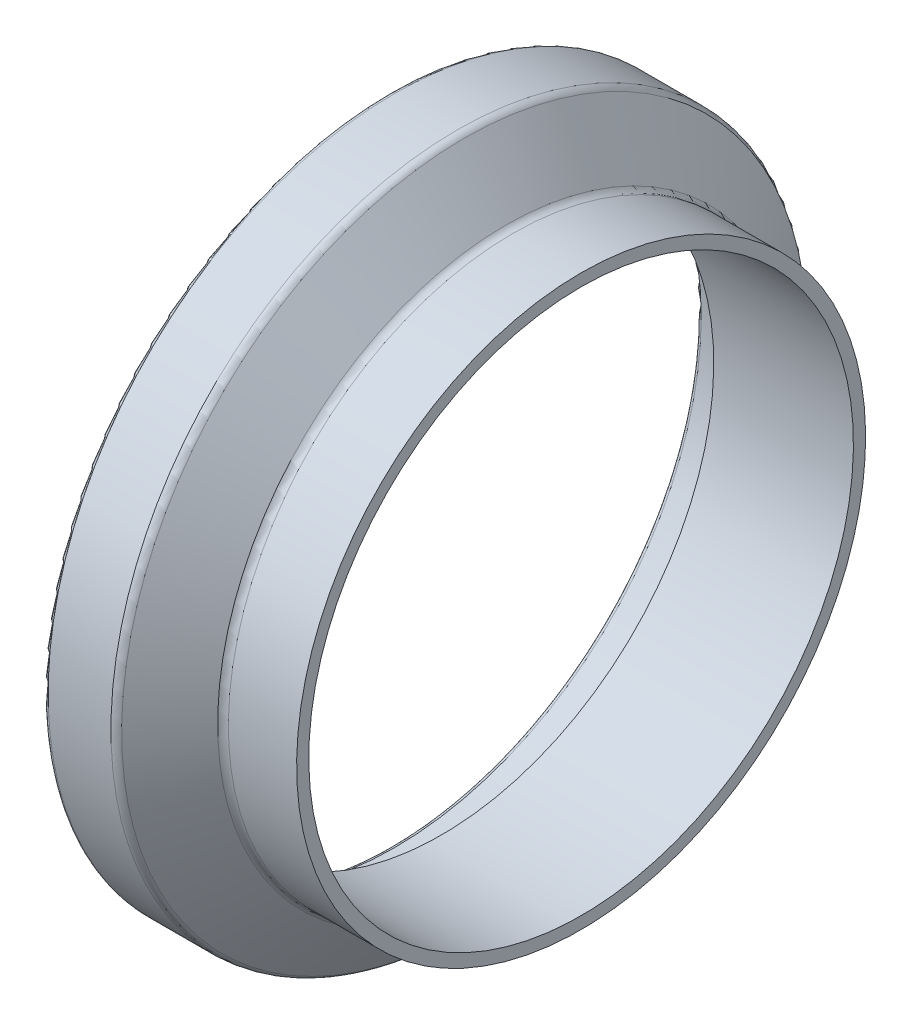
from build123d import *


with BuildPart() as part:
    # Sketch1 → Revolve1 (revolve)
    with BuildSketch(Plane.XY):
        with BuildLine():
            Line((-1.651983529, 48.6283), (-26.594783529, 48.6283))
            Line((-26.594783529, 48.6283), (-26.594783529, 53.9623))
            ThreePointArc((-26.594783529, 53.9623), (-26.832847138, 54.537036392), (-27.407583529, 54.7751))
            Line((-27.407583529, 54.7751), (-34.976783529, 54.7751))
            ThreePointArc((-34.976783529, 54.7751), (-35.551519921, 55.013163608), (-35.789583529, 55.5879))
            Line((-35.789583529, 55.5879), (-35.789583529, 61.0362))
            ThreePointArc((-35.789583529, 61.0362), (-35.551519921, 61.610936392), (-34.976783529, 61.849))
            Line((-34.976783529, 61.849), (-23.760413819, 61.849))
            ThreePointArc((-23.760413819, 61.849), (-23.046408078, 61.680873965), (-22.482437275, 61.2118244))
            Line((-22.482437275, 61.2118244), (-15.116711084, 51.4371756))
            ThreePointArc((-15.116711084, 51.4371756), (-14.552740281, 50.968126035), (-13.838734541, 50.8))
            Line((-13.838734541, 50.8), (-1.651983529, 50.8))
            Line((-1.651983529, 50.8), (-1.651983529, 48.6283))
        make_face()
    revolve(axis=Axis((0, 0, 0), (-1, 0, 0)))


solid = part.part
